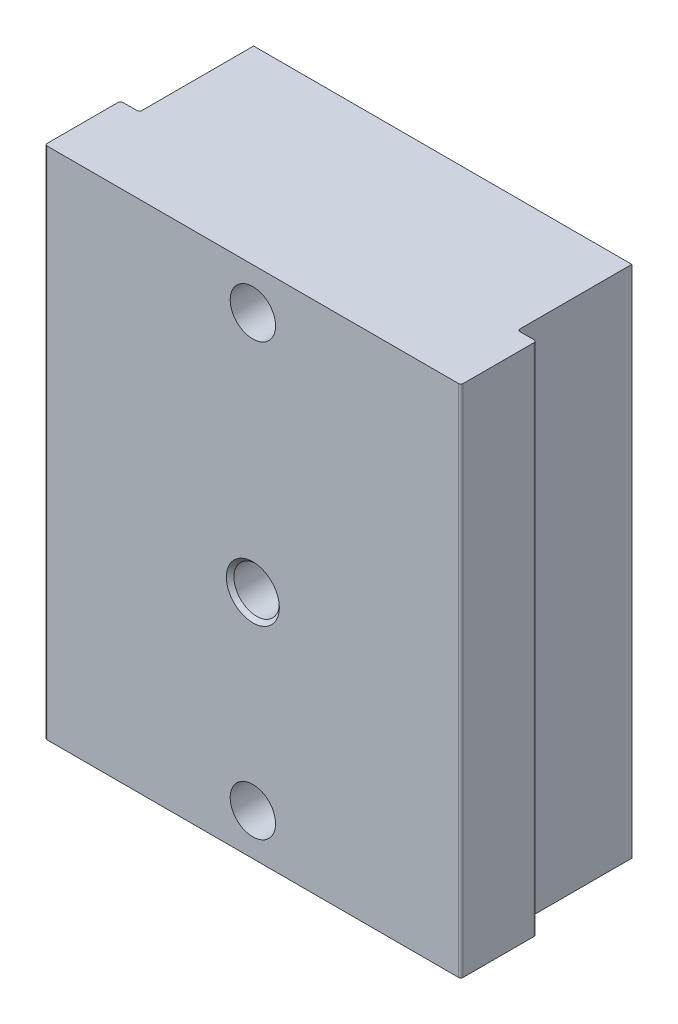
ISO-10303-21;
HEADER;
FILE_DESCRIPTION(('STEP AP214'),'2;1');
FILE_NAME('part.step','',(''),(''),'','','');
FILE_SCHEMA(('AUTOMOTIVE_DESIGN { 1 0 10303 214 1 1 1 1 }'));
ENDSEC;
DATA;
#1=APPLICATION_CONTEXT('core data for automotive mechanical design processes');
#2=APPLICATION_PROTOCOL_DEFINITION('international standard','automotive_design',2000,#1);
#3=PRODUCT_CONTEXT('',#1,'mechanical');
#4=PRODUCT('Part','Part','',(#3));
#5=PRODUCT_RELATED_PRODUCT_CATEGORY('part','',(#4));
#6=PRODUCT_DEFINITION_FORMATION('','',#4);
#7=PRODUCT_DEFINITION_CONTEXT('part definition',#1,'design');
#8=PRODUCT_DEFINITION('design','',#6,#7);
#9=PRODUCT_DEFINITION_SHAPE('','',#8);
#10=(LENGTH_UNIT() NAMED_UNIT(*) SI_UNIT(.MILLI.,.METRE.));
#11=(NAMED_UNIT(*) PLANE_ANGLE_UNIT() SI_UNIT($,.RADIAN.));
#12=(NAMED_UNIT(*) SI_UNIT($,.STERADIAN.) SOLID_ANGLE_UNIT());
#13=UNCERTAINTY_MEASURE_WITH_UNIT(LENGTH_MEASURE(1.E-05),#10,'distance_accuracy_value','');
#14=(GEOMETRIC_REPRESENTATION_CONTEXT(3) GLOBAL_UNCERTAINTY_ASSIGNED_CONTEXT((#13)) GLOBAL_UNIT_ASSIGNED_CONTEXT((#10,
#11,#12)) REPRESENTATION_CONTEXT('',''));
#15=CARTESIAN_POINT('',(0.,0.,0.));
#16=DIRECTION('',(0.,0.,1.));
#17=DIRECTION('',(1.,0.,0.));
#18=AXIS2_PLACEMENT_3D('',#15,#16,#17);
#19=CARTESIAN_POINT('',(0.,30.5,0.));
#20=DIRECTION('',(0.,0.,-1.));
#21=DIRECTION('',(-1.,0.,0.));
#22=AXIS2_PLACEMENT_3D('',#19,#20,#21);
#23=CYLINDRICAL_SURFACE('',#22,1.5);
#24=CARTESIAN_POINT('',(0.,30.5,-25.1));
#25=DIRECTION('',(0.,0.,-1.));
#26=DIRECTION('',(-1.,0.,0.));
#27=AXIS2_PLACEMENT_3D('',#24,#25,#26);
#28=CIRCLE('',#27,1.5);
#29=CARTESIAN_POINT('',(-1.5,30.5,-25.1));
#30=VERTEX_POINT('',#29);
#31=EDGE_CURVE('E250',#30,#30,#28,.T.);
#32=ORIENTED_EDGE('',*,*,#31,.T.);
#33=EDGE_LOOP('',(#32));
#34=FACE_BOUND('',#33,.T.);
#35=CARTESIAN_POINT('',(0.,30.5,-10.));
#36=DIRECTION('',(0.,0.,1.));
#37=DIRECTION('',(1.,0.,0.));
#38=AXIS2_PLACEMENT_3D('',#35,#36,#37);
#39=CIRCLE('',#38,1.5);
#40=CARTESIAN_POINT('',(1.5,30.5,-10.));
#41=VERTEX_POINT('',#40);
#42=EDGE_CURVE('E248',#41,#41,#39,.F.);
#43=ORIENTED_EDGE('',*,*,#42,.F.);
#44=EDGE_LOOP('',(#43));
#45=FACE_BOUND('',#44,.T.);
#46=ADVANCED_FACE('F34',(#34,#45),#23,.F.);
#47=CARTESIAN_POINT('',(27.5,68.,-10.));
#48=DIRECTION('',(-1.,0.,0.));
#49=DIRECTION('',(0.,0.,1.));
#50=AXIS2_PLACEMENT_3D('',#47,#48,#49);
#51=PLANE('',#50);
#52=DIRECTION('',(0.,0.,-1.));
#53=VECTOR('',#52,1.);
#54=CARTESIAN_POINT('',(27.5,0.,-10.));
#55=LINE('',#54,#53);
#56=CARTESIAN_POINT('',(27.5,0.,-0.3));
#57=VERTEX_POINT('',#56);
#58=CARTESIAN_POINT('',(27.5,0.,-9.7));
#59=VERTEX_POINT('',#58);
#60=EDGE_CURVE('E176',#57,#59,#55,.T.);
#61=ORIENTED_EDGE('',*,*,#60,.T.);
#62=DIRECTION('',(0.,-1.,0.));
#63=VECTOR('',#62,1.);
#64=CARTESIAN_POINT('',(27.5,68.,-9.7));
#65=LINE('',#64,#63);
#66=CARTESIAN_POINT('',(27.5,68.,-9.7));
#67=VERTEX_POINT('',#66);
#68=EDGE_CURVE('E214',#59,#67,#65,.F.);
#69=ORIENTED_EDGE('',*,*,#68,.T.);
#70=DIRECTION('',(0.,0.,-1.));
#71=VECTOR('',#70,1.);
#72=CARTESIAN_POINT('',(27.5,68.,-10.));
#73=LINE('',#72,#71);
#74=CARTESIAN_POINT('',(27.5,68.,-0.3));
#75=VERTEX_POINT('',#74);
#76=EDGE_CURVE('E197',#75,#67,#73,.T.);
#77=ORIENTED_EDGE('',*,*,#76,.F.);
#78=DIRECTION('',(0.,-1.,0.));
#79=VECTOR('',#78,1.);
#80=CARTESIAN_POINT('',(27.5,68.,-0.3));
#81=LINE('',#80,#79);
#82=EDGE_CURVE('E211',#75,#57,#81,.T.);
#83=ORIENTED_EDGE('',*,*,#82,.T.);
#84=EDGE_LOOP('',(#61,#69,#77,#83));
#85=FACE_BOUND('',#84,.T.);
#86=ADVANCED_FACE('F267',(#85),#51,.F.);
#87=CARTESIAN_POINT('',(27.5,68.,-10.));
#88=DIRECTION('',(0.,0.,1.));
#89=DIRECTION('',(1.,0.,0.));
#90=AXIS2_PLACEMENT_3D('',#87,#88,#89);
#91=PLANE('',#90);
#92=DIRECTION('',(-1.,0.,0.));
#93=VECTOR('',#92,1.);
#94=CARTESIAN_POINT('',(27.5,68.,-10.));
#95=LINE('',#94,#93);
#96=CARTESIAN_POINT('',(27.2,68.,-10.));
#97=VERTEX_POINT('',#96);
#98=CARTESIAN_POINT('',(25.3,68.,-10.));
#99=VERTEX_POINT('',#98);
#100=EDGE_CURVE('E149',#97,#99,#95,.T.);
#101=ORIENTED_EDGE('',*,*,#100,.F.);
#102=DIRECTION('',(0.,-1.,0.));
#103=VECTOR('',#102,1.);
#104=CARTESIAN_POINT('',(27.2,68.,-10.));
#105=LINE('',#104,#103);
#106=CARTESIAN_POINT('',(27.2,0.,-10.));
#107=VERTEX_POINT('',#106);
#108=EDGE_CURVE('E200',#97,#107,#105,.T.);
#109=ORIENTED_EDGE('',*,*,#108,.T.);
#110=DIRECTION('',(-1.,0.,0.));
#111=VECTOR('',#110,1.);
#112=CARTESIAN_POINT('',(27.5,0.,-10.));
#113=LINE('',#112,#111);
#114=CARTESIAN_POINT('',(25.3,0.,-10.));
#115=VERTEX_POINT('',#114);
#116=EDGE_CURVE('E179',#107,#115,#113,.T.);
#117=ORIENTED_EDGE('',*,*,#116,.T.);
#118=DIRECTION('',(0.,-1.,0.));
#119=VECTOR('',#118,1.);
#120=CARTESIAN_POINT('',(25.3,68.,-10.));
#121=LINE('',#120,#119);
#122=EDGE_CURVE('E158',#115,#99,#121,.F.);
#123=ORIENTED_EDGE('',*,*,#122,.T.);
#124=EDGE_LOOP('',(#101,#109,#117,#123));
#125=FACE_BOUND('',#124,.T.);
#126=ADVANCED_FACE('F273',(#125),#91,.F.);
#127=CARTESIAN_POINT('',(25.,68.,-25.1));
#128=DIRECTION('',(-1.,0.,0.));
#129=DIRECTION('',(0.,0.,1.));
#130=AXIS2_PLACEMENT_3D('',#127,#128,#129);
#131=PLANE('',#130);
#132=DIRECTION('',(0.,0.,-1.));
#133=VECTOR('',#132,1.);
#134=CARTESIAN_POINT('',(25.,68.,-25.1));
#135=LINE('',#134,#133);
#136=CARTESIAN_POINT('',(25.,68.,-10.3));
#137=VERTEX_POINT('',#136);
#138=CARTESIAN_POINT('',(25.,68.,-25.1));
#139=VERTEX_POINT('',#138);
#140=EDGE_CURVE('E135',#137,#139,#135,.T.);
#141=ORIENTED_EDGE('',*,*,#140,.F.);
#142=DIRECTION('',(0.,-1.,0.));
#143=VECTOR('',#142,1.);
#144=CARTESIAN_POINT('',(25.,0.,-10.3));
#145=LINE('',#144,#143);
#146=CARTESIAN_POINT('',(25.,0.,-10.3));
#147=VERTEX_POINT('',#146);
#148=EDGE_CURVE('E223',#137,#147,#145,.T.);
#149=ORIENTED_EDGE('',*,*,#148,.T.);
#150=DIRECTION('',(0.,0.,-1.));
#151=VECTOR('',#150,1.);
#152=CARTESIAN_POINT('',(25.,0.,-25.1));
#153=LINE('',#152,#151);
#154=CARTESIAN_POINT('',(25.,0.,-25.1));
#155=VERTEX_POINT('',#154);
#156=EDGE_CURVE('E155',#147,#155,#153,.T.);
#157=ORIENTED_EDGE('',*,*,#156,.T.);
#158=DIRECTION('',(0.,-1.,0.));
#159=VECTOR('',#158,1.);
#160=CARTESIAN_POINT('',(25.,68.,-25.1));
#161=LINE('',#160,#159);
#162=EDGE_CURVE('E152',#139,#155,#161,.T.);
#163=ORIENTED_EDGE('',*,*,#162,.F.);
#164=EDGE_LOOP('',(#141,#149,#157,#163));
#165=FACE_BOUND('',#164,.T.);
#166=ADVANCED_FACE('F153',(#165),#131,.F.);
#167=CARTESIAN_POINT('',(-25.,68.,-25.1));
#168=DIRECTION('',(0.,0.,1.));
#169=DIRECTION('',(1.,0.,0.));
#170=AXIS2_PLACEMENT_3D('',#167,#168,#169);
#171=PLANE('',#170);
#172=ORIENTED_EDGE('',*,*,#31,.F.);
#173=EDGE_LOOP('',(#172));
#174=FACE_BOUND('',#173,.T.);
#175=CARTESIAN_POINT('',(0.,5.5,-25.1));
#176=DIRECTION('',(0.,0.,-1.));
#177=DIRECTION('',(-1.,0.,0.));
#178=AXIS2_PLACEMENT_3D('',#175,#176,#177);
#179=CIRCLE('',#178,3.);
#180=CARTESIAN_POINT('',(-3.,5.5,-25.1));
#181=VERTEX_POINT('',#180);
#182=EDGE_CURVE('E361',#181,#181,#179,.T.);
#183=ORIENTED_EDGE('',*,*,#182,.F.);
#184=EDGE_LOOP('',(#183));
#185=FACE_BOUND('',#184,.T.);
#186=CARTESIAN_POINT('',(0.,62.5,-25.1));
#187=DIRECTION('',(0.,0.,-1.));
#188=DIRECTION('',(-1.,0.,0.));
#189=AXIS2_PLACEMENT_3D('',#186,#187,#188);
#190=CIRCLE('',#189,3.);
#191=CARTESIAN_POINT('',(-3.,62.5,-25.1));
#192=VERTEX_POINT('',#191);
#193=EDGE_CURVE('E355',#192,#192,#190,.T.);
#194=ORIENTED_EDGE('',*,*,#193,.F.);
#195=EDGE_LOOP('',(#194));
#196=FACE_BOUND('',#195,.T.);
#197=DIRECTION('',(-1.,0.,0.));
#198=VECTOR('',#197,1.);
#199=CARTESIAN_POINT('',(-25.,0.,-25.1));
#200=LINE('',#199,#198);
#201=CARTESIAN_POINT('',(-25.,0.,-25.1));
#202=VERTEX_POINT('',#201);
#203=EDGE_CURVE('E184',#155,#202,#200,.T.);
#204=ORIENTED_EDGE('',*,*,#203,.T.);
#205=DIRECTION('',(0.,-1.,0.));
#206=VECTOR('',#205,1.);
#207=CARTESIAN_POINT('',(-25.,68.,-25.1));
#208=LINE('',#207,#206);
#209=CARTESIAN_POINT('',(-25.,68.,-25.1));
#210=VERTEX_POINT('',#209);
#211=EDGE_CURVE('E159',#210,#202,#208,.T.);
#212=ORIENTED_EDGE('',*,*,#211,.F.);
#213=DIRECTION('',(-1.,0.,0.));
#214=VECTOR('',#213,1.);
#215=CARTESIAN_POINT('',(-25.,68.,-25.1));
#216=LINE('',#215,#214);
#217=EDGE_CURVE('E141',#139,#210,#216,.T.);
#218=ORIENTED_EDGE('',*,*,#217,.F.);
#219=ORIENTED_EDGE('',*,*,#162,.T.);
#220=EDGE_LOOP('',(#204,#212,#218,#219));
#221=FACE_BOUND('',#220,.T.);
#222=ADVANCED_FACE('F161',(#174,#185,#196,#221),#171,.F.);
#223=CARTESIAN_POINT('',(-25.,68.,-25.1));
#224=DIRECTION('',(1.,0.,0.));
#225=DIRECTION('',(0.,0.,-1.));
#226=AXIS2_PLACEMENT_3D('',#223,#224,#225);
#227=PLANE('',#226);
#228=DIRECTION('',(0.,0.,1.));
#229=VECTOR('',#228,1.);
#230=CARTESIAN_POINT('',(-25.,0.,-25.1));
#231=LINE('',#230,#229);
#232=CARTESIAN_POINT('',(-25.,0.,-10.3));
#233=VERTEX_POINT('',#232);
#234=EDGE_CURVE('E186',#202,#233,#231,.T.);
#235=ORIENTED_EDGE('',*,*,#234,.T.);
#236=DIRECTION('',(0.,-1.,0.));
#237=VECTOR('',#236,1.);
#238=CARTESIAN_POINT('',(-25.,68.,-10.3));
#239=LINE('',#238,#237);
#240=CARTESIAN_POINT('',(-25.,68.,-10.3));
#241=VERTEX_POINT('',#240);
#242=EDGE_CURVE('E230',#233,#241,#239,.F.);
#243=ORIENTED_EDGE('',*,*,#242,.T.);
#244=DIRECTION('',(0.,0.,1.));
#245=VECTOR('',#244,1.);
#246=CARTESIAN_POINT('',(-25.,68.,-25.1));
#247=LINE('',#246,#245);
#248=EDGE_CURVE('E164',#210,#241,#247,.T.);
#249=ORIENTED_EDGE('',*,*,#248,.F.);
#250=ORIENTED_EDGE('',*,*,#211,.T.);
#251=EDGE_LOOP('',(#235,#243,#249,#250));
#252=FACE_BOUND('',#251,.T.);
#253=ADVANCED_FACE('F307',(#252),#227,.F.);
#254=CARTESIAN_POINT('',(-27.5,68.,-10.));
#255=DIRECTION('',(0.,0.,1.));
#256=DIRECTION('',(1.,0.,0.));
#257=AXIS2_PLACEMENT_3D('',#254,#255,#256);
#258=PLANE('',#257);
#259=DIRECTION('',(-1.,0.,0.));
#260=VECTOR('',#259,1.);
#261=CARTESIAN_POINT('',(-27.5,68.,-10.));
#262=LINE('',#261,#260);
#263=CARTESIAN_POINT('',(-25.3,68.,-10.));
#264=VERTEX_POINT('',#263);
#265=CARTESIAN_POINT('',(-27.2,68.,-10.));
#266=VERTEX_POINT('',#265);
#267=EDGE_CURVE('E166',#264,#266,#262,.T.);
#268=ORIENTED_EDGE('',*,*,#267,.F.);
#269=DIRECTION('',(0.,-1.,0.));
#270=VECTOR('',#269,1.);
#271=CARTESIAN_POINT('',(-25.3,0.,-10.));
#272=LINE('',#271,#270);
#273=CARTESIAN_POINT('',(-25.3,0.,-10.));
#274=VERTEX_POINT('',#273);
#275=EDGE_CURVE('E227',#264,#274,#272,.T.);
#276=ORIENTED_EDGE('',*,*,#275,.T.);
#277=DIRECTION('',(-1.,0.,0.));
#278=VECTOR('',#277,1.);
#279=CARTESIAN_POINT('',(-27.5,0.,-10.));
#280=LINE('',#279,#278);
#281=CARTESIAN_POINT('',(-27.2,0.,-10.));
#282=VERTEX_POINT('',#281);
#283=EDGE_CURVE('E189',#274,#282,#280,.T.);
#284=ORIENTED_EDGE('',*,*,#283,.T.);
#285=DIRECTION('',(0.,-1.,0.));
#286=VECTOR('',#285,1.);
#287=CARTESIAN_POINT('',(-27.2,68.,-10.));
#288=LINE('',#287,#286);
#289=EDGE_CURVE('E225',#282,#266,#288,.F.);
#290=ORIENTED_EDGE('',*,*,#289,.T.);
#291=EDGE_LOOP('',(#268,#276,#284,#290));
#292=FACE_BOUND('',#291,.T.);
#293=ADVANCED_FACE('F303',(#292),#258,.F.);
#294=CARTESIAN_POINT('',(-27.5,68.,-10.));
#295=DIRECTION('',(1.,0.,0.));
#296=DIRECTION('',(0.,0.,-1.));
#297=AXIS2_PLACEMENT_3D('',#294,#295,#296);
#298=PLANE('',#297);
#299=DIRECTION('',(0.,0.,1.));
#300=VECTOR('',#299,1.);
#301=CARTESIAN_POINT('',(-27.5,68.,-10.));
#302=LINE('',#301,#300);
#303=CARTESIAN_POINT('',(-27.5,68.,-9.7));
#304=VERTEX_POINT('',#303);
#305=CARTESIAN_POINT('',(-27.5,68.,-0.3));
#306=VERTEX_POINT('',#305);
#307=EDGE_CURVE('E172',#304,#306,#302,.T.);
#308=ORIENTED_EDGE('',*,*,#307,.F.);
#309=DIRECTION('',(0.,-1.,0.));
#310=VECTOR('',#309,1.);
#311=CARTESIAN_POINT('',(-27.5,68.,-9.7));
#312=LINE('',#311,#310);
#313=CARTESIAN_POINT('',(-27.5,0.,-9.7));
#314=VERTEX_POINT('',#313);
#315=EDGE_CURVE('E234',#304,#314,#312,.T.);
#316=ORIENTED_EDGE('',*,*,#315,.T.);
#317=DIRECTION('',(0.,0.,1.));
#318=VECTOR('',#317,1.);
#319=CARTESIAN_POINT('',(-27.5,0.,-10.));
#320=LINE('',#319,#318);
#321=CARTESIAN_POINT('',(-27.5,0.,-0.3));
#322=VERTEX_POINT('',#321);
#323=EDGE_CURVE('E192',#314,#322,#320,.T.);
#324=ORIENTED_EDGE('',*,*,#323,.T.);
#325=DIRECTION('',(0.,-1.,0.));
#326=VECTOR('',#325,1.);
#327=CARTESIAN_POINT('',(-27.5,68.,-0.3));
#328=LINE('',#327,#326);
#329=EDGE_CURVE('E232',#322,#306,#328,.F.);
#330=ORIENTED_EDGE('',*,*,#329,.T.);
#331=EDGE_LOOP('',(#308,#316,#324,#330));
#332=FACE_BOUND('',#331,.T.);
#333=ADVANCED_FACE('F299',(#332),#298,.F.);
#334=CARTESIAN_POINT('',(-27.5,68.,0.));
#335=DIRECTION('',(0.,0.,-1.));
#336=DIRECTION('',(-1.,0.,0.));
#337=AXIS2_PLACEMENT_3D('',#334,#335,#336);
#338=PLANE('',#337);
#339=CARTESIAN_POINT('',(0.,30.5,0.));
#340=DIRECTION('',(0.,0.,-1.));
#341=DIRECTION('',(-1.,0.,0.));
#342=AXIS2_PLACEMENT_3D('',#339,#340,#341);
#343=CIRCLE('',#342,3.5);
#344=CARTESIAN_POINT('',(-3.5,30.5,0.));
#345=VERTEX_POINT('',#344);
#346=EDGE_CURVE('E11',#345,#345,#343,.T.);
#347=ORIENTED_EDGE('',*,*,#346,.T.);
#348=EDGE_LOOP('',(#347));
#349=FACE_BOUND('',#348,.T.);
#350=CARTESIAN_POINT('',(0.,5.5,0.));
#351=DIRECTION('',(0.,0.,-1.));
#352=DIRECTION('',(-1.,0.,0.));
#353=AXIS2_PLACEMENT_3D('',#350,#351,#352);
#354=CIRCLE('',#353,3.);
#355=CARTESIAN_POINT('',(-3.,5.5,0.));
#356=VERTEX_POINT('',#355);
#357=EDGE_CURVE('E358',#356,#356,#354,.T.);
#358=ORIENTED_EDGE('',*,*,#357,.T.);
#359=EDGE_LOOP('',(#358));
#360=FACE_BOUND('',#359,.T.);
#361=CARTESIAN_POINT('',(0.,62.5,0.));
#362=DIRECTION('',(0.,0.,-1.));
#363=DIRECTION('',(-1.,0.,0.));
#364=AXIS2_PLACEMENT_3D('',#361,#362,#363);
#365=CIRCLE('',#364,3.);
#366=CARTESIAN_POINT('',(-3.,62.5,0.));
#367=VERTEX_POINT('',#366);
#368=EDGE_CURVE('E180',#367,#367,#365,.T.);
#369=ORIENTED_EDGE('',*,*,#368,.T.);
#370=EDGE_LOOP('',(#369));
#371=FACE_BOUND('',#370,.T.);
#372=DIRECTION('',(1.,0.,0.));
#373=VECTOR('',#372,1.);
#374=CARTESIAN_POINT('',(-27.5,0.,0.));
#375=LINE('',#374,#373);
#376=CARTESIAN_POINT('',(-27.2,0.,0.));
#377=VERTEX_POINT('',#376);
#378=CARTESIAN_POINT('',(27.2,0.,0.));
#379=VERTEX_POINT('',#378);
#380=EDGE_CURVE('E195',#377,#379,#375,.T.);
#381=ORIENTED_EDGE('',*,*,#380,.T.);
#382=DIRECTION('',(0.,-1.,0.));
#383=VECTOR('',#382,1.);
#384=CARTESIAN_POINT('',(27.2,68.,0.));
#385=LINE('',#384,#383);
#386=CARTESIAN_POINT('',(27.2,68.,0.));
#387=VERTEX_POINT('',#386);
#388=EDGE_CURVE('E49',#379,#387,#385,.F.);
#389=ORIENTED_EDGE('',*,*,#388,.T.);
#390=DIRECTION('',(1.,0.,0.));
#391=VECTOR('',#390,1.);
#392=CARTESIAN_POINT('',(-27.5,68.,0.));
#393=LINE('',#392,#391);
#394=CARTESIAN_POINT('',(-27.2,68.,0.));
#395=VERTEX_POINT('',#394);
#396=EDGE_CURVE('E174',#395,#387,#393,.T.);
#397=ORIENTED_EDGE('',*,*,#396,.F.);
#398=DIRECTION('',(0.,-1.,0.));
#399=VECTOR('',#398,1.);
#400=CARTESIAN_POINT('',(-27.2,68.,0.));
#401=LINE('',#400,#399);
#402=EDGE_CURVE('E237',#395,#377,#401,.T.);
#403=ORIENTED_EDGE('',*,*,#402,.T.);
#404=EDGE_LOOP('',(#381,#389,#397,#403));
#405=FACE_BOUND('',#404,.T.);
#406=ADVANCED_FACE('F292',(#349,#360,#371,#405),#338,.F.);
#407=CARTESIAN_POINT('',(0.,68.,0.));
#408=DIRECTION('',(0.,1.,0.));
#409=DIRECTION('',(0.,0.,1.));
#410=AXIS2_PLACEMENT_3D('',#407,#408,#409);
#411=PLANE('',#410);
#412=ORIENTED_EDGE('',*,*,#76,.T.);
#413=CARTESIAN_POINT('',(27.2,68.,-9.7));
#414=DIRECTION('',(0.,1.,0.));
#415=DIRECTION('',(0.,0.,1.));
#416=AXIS2_PLACEMENT_3D('',#413,#414,#415);
#417=CIRCLE('',#416,0.3);
#418=EDGE_CURVE('E221',#67,#97,#417,.T.);
#419=ORIENTED_EDGE('',*,*,#418,.T.);
#420=ORIENTED_EDGE('',*,*,#100,.T.);
#421=CARTESIAN_POINT('',(25.3,68.,-10.3));
#422=DIRECTION('',(0.,1.,0.));
#423=DIRECTION('',(0.,0.,1.));
#424=AXIS2_PLACEMENT_3D('',#421,#422,#423);
#425=CIRCLE('',#424,0.3);
#426=EDGE_CURVE('E145',#99,#137,#425,.F.);
#427=ORIENTED_EDGE('',*,*,#426,.T.);
#428=ORIENTED_EDGE('',*,*,#140,.T.);
#429=ORIENTED_EDGE('',*,*,#217,.T.);
#430=ORIENTED_EDGE('',*,*,#248,.T.);
#431=CARTESIAN_POINT('',(-25.3,68.,-10.3));
#432=DIRECTION('',(0.,1.,0.));
#433=DIRECTION('',(0.,0.,1.));
#434=AXIS2_PLACEMENT_3D('',#431,#432,#433);
#435=CIRCLE('',#434,0.3);
#436=EDGE_CURVE('E246',#241,#264,#435,.F.);
#437=ORIENTED_EDGE('',*,*,#436,.T.);
#438=ORIENTED_EDGE('',*,*,#267,.T.);
#439=CARTESIAN_POINT('',(-27.2,68.,-9.7));
#440=DIRECTION('',(0.,1.,0.));
#441=DIRECTION('',(0.,0.,1.));
#442=AXIS2_PLACEMENT_3D('',#439,#440,#441);
#443=CIRCLE('',#442,0.3);
#444=EDGE_CURVE('E219',#266,#304,#443,.T.);
#445=ORIENTED_EDGE('',*,*,#444,.T.);
#446=ORIENTED_EDGE('',*,*,#307,.T.);
#447=CARTESIAN_POINT('',(-27.2,68.,-0.3));
#448=DIRECTION('',(0.,1.,0.));
#449=DIRECTION('',(0.,0.,1.));
#450=AXIS2_PLACEMENT_3D('',#447,#448,#449);
#451=CIRCLE('',#450,0.3);
#452=EDGE_CURVE('E56',#306,#395,#451,.T.);
#453=ORIENTED_EDGE('',*,*,#452,.T.);
#454=ORIENTED_EDGE('',*,*,#396,.T.);
#455=CARTESIAN_POINT('',(27.2,68.,-0.3));
#456=DIRECTION('',(0.,1.,0.));
#457=DIRECTION('',(0.,0.,1.));
#458=AXIS2_PLACEMENT_3D('',#455,#456,#457);
#459=CIRCLE('',#458,0.3);
#460=EDGE_CURVE('E217',#387,#75,#459,.T.);
#461=ORIENTED_EDGE('',*,*,#460,.T.);
#462=EDGE_LOOP('',(#412,#419,#420,#427,#428,#429,#430,#437,#438,#445,#446,#453,#454,#461));
#463=FACE_BOUND('',#462,.T.);
#464=ADVANCED_FACE('F138',(#463),#411,.T.);
#465=CARTESIAN_POINT('',(0.,0.,0.));
#466=DIRECTION('',(0.,1.,0.));
#467=DIRECTION('',(0.,0.,1.));
#468=AXIS2_PLACEMENT_3D('',#465,#466,#467);
#469=PLANE('',#468);
#470=ORIENTED_EDGE('',*,*,#116,.F.);
#471=CARTESIAN_POINT('',(27.2,0.,-9.7));
#472=DIRECTION('',(0.,1.,0.));
#473=DIRECTION('',(0.,0.,1.));
#474=AXIS2_PLACEMENT_3D('',#471,#472,#473);
#475=CIRCLE('',#474,0.3);
#476=EDGE_CURVE('E209',#107,#59,#475,.F.);
#477=ORIENTED_EDGE('',*,*,#476,.T.);
#478=ORIENTED_EDGE('',*,*,#60,.F.);
#479=CARTESIAN_POINT('',(27.2,0.,-0.3));
#480=DIRECTION('',(0.,1.,0.));
#481=DIRECTION('',(0.,0.,1.));
#482=AXIS2_PLACEMENT_3D('',#479,#480,#481);
#483=CIRCLE('',#482,0.3);
#484=EDGE_CURVE('E205',#57,#379,#483,.F.);
#485=ORIENTED_EDGE('',*,*,#484,.T.);
#486=ORIENTED_EDGE('',*,*,#380,.F.);
#487=CARTESIAN_POINT('',(-27.2,0.,-0.3));
#488=DIRECTION('',(0.,1.,0.));
#489=DIRECTION('',(0.,0.,1.));
#490=AXIS2_PLACEMENT_3D('',#487,#488,#489);
#491=CIRCLE('',#490,0.3);
#492=EDGE_CURVE('E203',#377,#322,#491,.F.);
#493=ORIENTED_EDGE('',*,*,#492,.T.);
#494=ORIENTED_EDGE('',*,*,#323,.F.);
#495=CARTESIAN_POINT('',(-27.2,0.,-9.7));
#496=DIRECTION('',(0.,1.,0.));
#497=DIRECTION('',(0.,0.,1.));
#498=AXIS2_PLACEMENT_3D('',#495,#496,#497);
#499=CIRCLE('',#498,0.3);
#500=EDGE_CURVE('E207',#314,#282,#499,.F.);
#501=ORIENTED_EDGE('',*,*,#500,.T.);
#502=ORIENTED_EDGE('',*,*,#283,.F.);
#503=CARTESIAN_POINT('',(-25.3,0.,-10.3));
#504=DIRECTION('',(0.,1.,0.));
#505=DIRECTION('',(0.,0.,1.));
#506=AXIS2_PLACEMENT_3D('',#503,#504,#505);
#507=CIRCLE('',#506,0.3);
#508=EDGE_CURVE('E244',#274,#233,#507,.T.);
#509=ORIENTED_EDGE('',*,*,#508,.T.);
#510=ORIENTED_EDGE('',*,*,#234,.F.);
#511=ORIENTED_EDGE('',*,*,#203,.F.);
#512=ORIENTED_EDGE('',*,*,#156,.F.);
#513=CARTESIAN_POINT('',(25.3,0.,-10.3));
#514=DIRECTION('',(0.,1.,0.));
#515=DIRECTION('',(0.,0.,1.));
#516=AXIS2_PLACEMENT_3D('',#513,#514,#515);
#517=CIRCLE('',#516,0.3);
#518=EDGE_CURVE('E241',#147,#115,#517,.T.);
#519=ORIENTED_EDGE('',*,*,#518,.T.);
#520=EDGE_LOOP('',(#470,#477,#478,#485,#486,#493,#494,#501,#502,#509,#510,#511,#512,#519));
#521=FACE_BOUND('',#520,.T.);
#522=ADVANCED_FACE('F291',(#521),#469,.F.);
#523=CARTESIAN_POINT('',(27.2,68.,-9.7));
#524=DIRECTION('',(0.,-1.,0.));
#525=DIRECTION('',(0.,0.,-1.));
#526=AXIS2_PLACEMENT_3D('',#523,#524,#525);
#527=CYLINDRICAL_SURFACE('',#526,0.3);
#528=ORIENTED_EDGE('',*,*,#418,.F.);
#529=ORIENTED_EDGE('',*,*,#68,.F.);
#530=ORIENTED_EDGE('',*,*,#476,.F.);
#531=ORIENTED_EDGE('',*,*,#108,.F.);
#532=EDGE_LOOP('',(#528,#529,#530,#531));
#533=FACE_BOUND('',#532,.T.);
#534=ADVANCED_FACE('F295',(#533),#527,.T.);
#535=CARTESIAN_POINT('',(25.3,68.,-10.3));
#536=DIRECTION('',(0.,1.,0.));
#537=DIRECTION('',(0.,0.,1.));
#538=AXIS2_PLACEMENT_3D('',#535,#536,#537);
#539=CYLINDRICAL_SURFACE('',#538,0.3);
#540=ORIENTED_EDGE('',*,*,#426,.F.);
#541=ORIENTED_EDGE('',*,*,#122,.F.);
#542=ORIENTED_EDGE('',*,*,#518,.F.);
#543=ORIENTED_EDGE('',*,*,#148,.F.);
#544=EDGE_LOOP('',(#540,#541,#542,#543));
#545=FACE_BOUND('',#544,.T.);
#546=ADVANCED_FACE('F322',(#545),#539,.F.);
#547=CARTESIAN_POINT('',(-25.3,68.,-10.3));
#548=DIRECTION('',(0.,1.,0.));
#549=DIRECTION('',(0.,0.,1.));
#550=AXIS2_PLACEMENT_3D('',#547,#548,#549);
#551=CYLINDRICAL_SURFACE('',#550,0.3);
#552=ORIENTED_EDGE('',*,*,#436,.F.);
#553=ORIENTED_EDGE('',*,*,#242,.F.);
#554=ORIENTED_EDGE('',*,*,#508,.F.);
#555=ORIENTED_EDGE('',*,*,#275,.F.);
#556=EDGE_LOOP('',(#552,#553,#554,#555));
#557=FACE_BOUND('',#556,.T.);
#558=ADVANCED_FACE('F326',(#557),#551,.F.);
#559=CARTESIAN_POINT('',(-27.2,68.,-9.7));
#560=DIRECTION('',(0.,-1.,0.));
#561=DIRECTION('',(0.,0.,-1.));
#562=AXIS2_PLACEMENT_3D('',#559,#560,#561);
#563=CYLINDRICAL_SURFACE('',#562,0.3);
#564=ORIENTED_EDGE('',*,*,#444,.F.);
#565=ORIENTED_EDGE('',*,*,#289,.F.);
#566=ORIENTED_EDGE('',*,*,#500,.F.);
#567=ORIENTED_EDGE('',*,*,#315,.F.);
#568=EDGE_LOOP('',(#564,#565,#566,#567));
#569=FACE_BOUND('',#568,.T.);
#570=ADVANCED_FACE('F330',(#569),#563,.T.);
#571=CARTESIAN_POINT('',(27.2,68.,-0.3));
#572=DIRECTION('',(0.,-1.,0.));
#573=DIRECTION('',(0.,0.,-1.));
#574=AXIS2_PLACEMENT_3D('',#571,#572,#573);
#575=CYLINDRICAL_SURFACE('',#574,0.3);
#576=ORIENTED_EDGE('',*,*,#460,.F.);
#577=ORIENTED_EDGE('',*,*,#388,.F.);
#578=ORIENTED_EDGE('',*,*,#484,.F.);
#579=ORIENTED_EDGE('',*,*,#82,.F.);
#580=EDGE_LOOP('',(#576,#577,#578,#579));
#581=FACE_BOUND('',#580,.T.);
#582=ADVANCED_FACE('F334',(#581),#575,.T.);
#583=CARTESIAN_POINT('',(-27.2,68.,-0.3));
#584=DIRECTION('',(0.,-1.,0.));
#585=DIRECTION('',(0.,0.,-1.));
#586=AXIS2_PLACEMENT_3D('',#583,#584,#585);
#587=CYLINDRICAL_SURFACE('',#586,0.3);
#588=ORIENTED_EDGE('',*,*,#452,.F.);
#589=ORIENTED_EDGE('',*,*,#329,.F.);
#590=ORIENTED_EDGE('',*,*,#492,.F.);
#591=ORIENTED_EDGE('',*,*,#402,.F.);
#592=EDGE_LOOP('',(#588,#589,#590,#591));
#593=FACE_BOUND('',#592,.T.);
#594=ADVANCED_FACE('F287',(#593),#587,.T.);
#595=CARTESIAN_POINT('',(0.,62.5,0.));
#596=DIRECTION('',(0.,0.,-1.));
#597=DIRECTION('',(-1.,0.,0.));
#598=AXIS2_PLACEMENT_3D('',#595,#596,#597);
#599=CYLINDRICAL_SURFACE('',#598,3.);
#600=ORIENTED_EDGE('',*,*,#368,.F.);
#601=EDGE_LOOP('',(#600));
#602=FACE_BOUND('',#601,.T.);
#603=ORIENTED_EDGE('',*,*,#193,.T.);
#604=EDGE_LOOP('',(#603));
#605=FACE_BOUND('',#604,.T.);
#606=ADVANCED_FACE('F283',(#602,#605),#599,.F.);
#607=CARTESIAN_POINT('',(0.,5.5,0.));
#608=DIRECTION('',(0.,0.,-1.));
#609=DIRECTION('',(-1.,0.,0.));
#610=AXIS2_PLACEMENT_3D('',#607,#608,#609);
#611=CYLINDRICAL_SURFACE('',#610,3.);
#612=ORIENTED_EDGE('',*,*,#357,.F.);
#613=EDGE_LOOP('',(#612));
#614=FACE_BOUND('',#613,.T.);
#615=ORIENTED_EDGE('',*,*,#182,.T.);
#616=EDGE_LOOP('',(#615));
#617=FACE_BOUND('',#616,.T.);
#618=ADVANCED_FACE('F280',(#614,#617),#611,.F.);
#619=CARTESIAN_POINT('',(0.,30.5,-10.));
#620=DIRECTION('',(0.,0.,1.));
#621=DIRECTION('',(1.,0.,0.));
#622=AXIS2_PLACEMENT_3D('',#619,#620,#621);
#623=PLANE('',#622);
#624=CARTESIAN_POINT('',(0.,30.5,-10.));
#625=DIRECTION('',(0.,0.,1.));
#626=DIRECTION('',(1.,0.,0.));
#627=AXIS2_PLACEMENT_3D('',#624,#625,#626);
#628=CIRCLE('',#627,3.);
#629=CARTESIAN_POINT('',(3.,30.5,-10.));
#630=VERTEX_POINT('',#629);
#631=EDGE_CURVE('E251',#630,#630,#628,.T.);
#632=ORIENTED_EDGE('',*,*,#631,.T.);
#633=EDGE_LOOP('',(#632));
#634=FACE_BOUND('',#633,.T.);
#635=ORIENTED_EDGE('',*,*,#42,.T.);
#636=EDGE_LOOP('',(#635));
#637=FACE_BOUND('',#636,.T.);
#638=ADVANCED_FACE('F263',(#634,#637),#623,.T.);
#639=CARTESIAN_POINT('',(0.,30.5,-10.));
#640=DIRECTION('',(0.,0.,1.));
#641=DIRECTION('',(1.,0.,0.));
#642=AXIS2_PLACEMENT_3D('',#639,#640,#641);
#643=CYLINDRICAL_SURFACE('',#642,3.);
#644=CARTESIAN_POINT('',(0.,30.5,-0.499999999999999));
#645=DIRECTION('',(0.,0.,-1.));
#646=DIRECTION('',(-1.,0.,0.));
#647=AXIS2_PLACEMENT_3D('',#644,#645,#646);
#648=CIRCLE('',#647,3.);
#649=CARTESIAN_POINT('',(-3.,30.5,-0.499999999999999));
#650=VERTEX_POINT('',#649);
#651=EDGE_CURVE('E42',#650,#650,#648,.F.);
#652=ORIENTED_EDGE('',*,*,#651,.T.);
#653=EDGE_LOOP('',(#652));
#654=FACE_BOUND('',#653,.T.);
#655=ORIENTED_EDGE('',*,*,#631,.F.);
#656=EDGE_LOOP('',(#655));
#657=FACE_BOUND('',#656,.T.);
#658=ADVANCED_FACE('F255',(#654,#657),#643,.F.);
#659=CARTESIAN_POINT('',(0.,30.5,-0.499999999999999));
#660=DIRECTION('',(0.,0.,1.));
#661=DIRECTION('',(1.,0.,0.));
#662=AXIS2_PLACEMENT_3D('',#659,#660,#661);
#663=CONICAL_SURFACE('',#662,3.,0.785398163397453);
#664=ORIENTED_EDGE('',*,*,#346,.F.);
#665=EDGE_LOOP('',(#664));
#666=FACE_BOUND('',#665,.T.);
#667=ORIENTED_EDGE('',*,*,#651,.F.);
#668=EDGE_LOOP('',(#667));
#669=FACE_BOUND('',#668,.T.);
#670=ADVANCED_FACE('F36',(#666,#669),#663,.F.);
#671=CLOSED_SHELL('',(#46,#86,#126,#166,#222,#253,#293,#333,#406,#464,#522,#534,#546,#558,#570,
#582,#594,#606,#618,#638,#658,#670));
#672=MANIFOLD_SOLID_BREP('B2',#671);
#673=ADVANCED_BREP_SHAPE_REPRESENTATION('',(#18,#672),#14);
#674=SHAPE_DEFINITION_REPRESENTATION(#9,#673);
ENDSEC;
END-ISO-10303-21;
